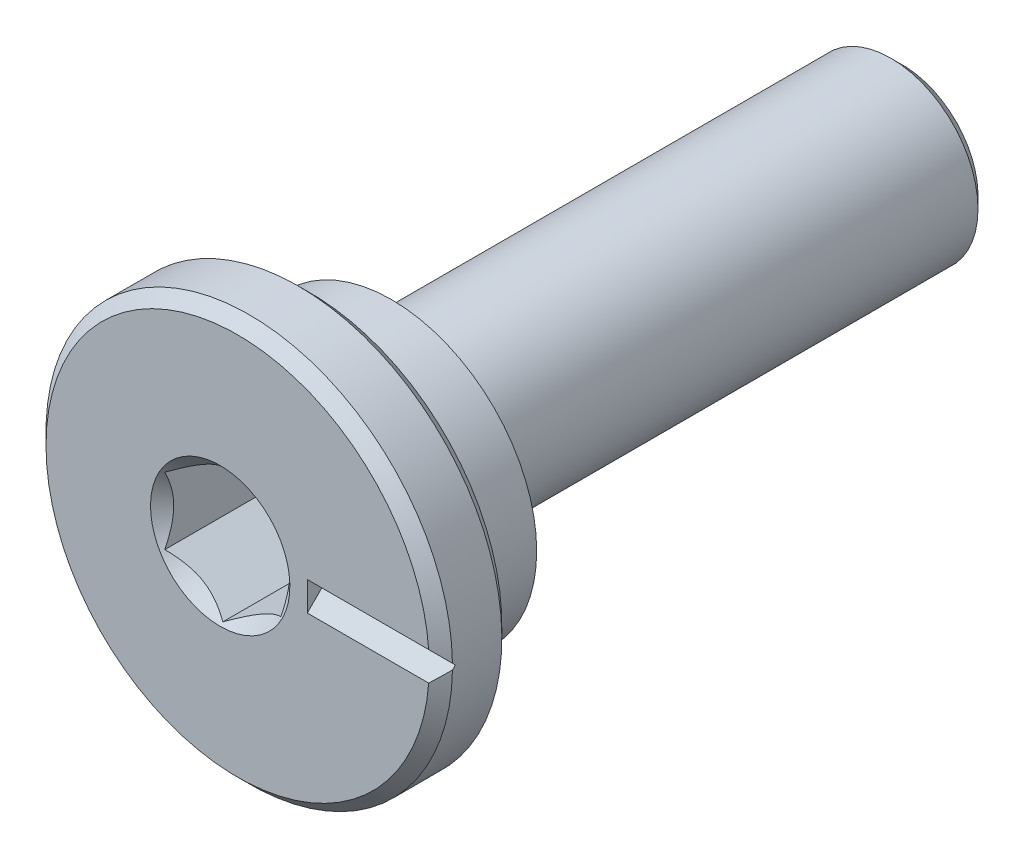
ISO-10303-21;
HEADER;
FILE_DESCRIPTION(('STEP AP214'),'2;1');
FILE_NAME('part.step','',(''),(''),'','','');
FILE_SCHEMA(('AUTOMOTIVE_DESIGN { 1 0 10303 214 1 1 1 1 }'));
ENDSEC;
DATA;
#1=APPLICATION_CONTEXT('core data for automotive mechanical design processes');
#2=APPLICATION_PROTOCOL_DEFINITION('international standard','automotive_design',2000,#1);
#3=PRODUCT_CONTEXT('',#1,'mechanical');
#4=PRODUCT('Part','Part','',(#3));
#5=PRODUCT_RELATED_PRODUCT_CATEGORY('part','',(#4));
#6=PRODUCT_DEFINITION_FORMATION('','',#4);
#7=PRODUCT_DEFINITION_CONTEXT('part definition',#1,'design');
#8=PRODUCT_DEFINITION('design','',#6,#7);
#9=PRODUCT_DEFINITION_SHAPE('','',#8);
#10=(LENGTH_UNIT() NAMED_UNIT(*) SI_UNIT(.MILLI.,.METRE.));
#11=(NAMED_UNIT(*) PLANE_ANGLE_UNIT() SI_UNIT($,.RADIAN.));
#12=(NAMED_UNIT(*) SI_UNIT($,.STERADIAN.) SOLID_ANGLE_UNIT());
#13=UNCERTAINTY_MEASURE_WITH_UNIT(LENGTH_MEASURE(1.E-05),#10,'distance_accuracy_value','');
#14=(GEOMETRIC_REPRESENTATION_CONTEXT(3) GLOBAL_UNCERTAINTY_ASSIGNED_CONTEXT((#13)) GLOBAL_UNIT_ASSIGNED_CONTEXT((#10,
#11,#12)) REPRESENTATION_CONTEXT('',''));
#15=CARTESIAN_POINT('',(0.,0.,0.));
#16=DIRECTION('',(0.,0.,1.));
#17=DIRECTION('',(1.,0.,0.));
#18=AXIS2_PLACEMENT_3D('',#15,#16,#17);
#19=CARTESIAN_POINT('',(0.,0.,-1.));
#20=DIRECTION('',(0.,0.,1.));
#21=DIRECTION('',(-4.13512093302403E-12,-1.,0.));
#22=AXIS2_PLACEMENT_3D('',#19,#20,#21);
#23=PLANE('',#22);
#24=DIRECTION('',(-4.13512093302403E-12,-1.,0.));
#25=VECTOR('',#24,1.);
#26=CARTESIAN_POINT('',(2.,-8.27024186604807E-12,-1.));
#27=LINE('',#26,#25);
#28=CARTESIAN_POINT('',(2.00000000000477,-8.27093497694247E-12,-1.00000000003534));
#29=VERTEX_POINT('',#28);
#30=CARTESIAN_POINT('',(2.00000000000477,1.15470053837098,-1.));
#31=VERTEX_POINT('',#30);
#32=EDGE_CURVE('E70',#29,#31,#27,.F.);
#33=ORIENTED_EDGE('',*,*,#32,.T.);
#34=DIRECTION('',(-0.86602540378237,0.500000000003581,0.));
#35=VECTOR('',#34,1.);
#36=CARTESIAN_POINT('',(2.00000000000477,1.15470053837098,-1.));
#37=LINE('',#36,#35);
#38=CARTESIAN_POINT('',(1.00000000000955,1.73205080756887,-1.00000000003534));
#39=VERTEX_POINT('',#38);
#40=EDGE_CURVE('E339',#31,#39,#37,.T.);
#41=ORIENTED_EDGE('',*,*,#40,.T.);
#42=CARTESIAN_POINT('',(0.,0.,-1.00000000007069));
#43=DIRECTION('',(0.,0.,1.));
#44=DIRECTION('',(-4.13512093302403E-12,-1.,0.));
#45=AXIS2_PLACEMENT_3D('',#42,#43,#44);
#46=CIRCLE('',#45,2.00000000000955);
#47=EDGE_CURVE('E17',#39,#29,#46,.F.);
#48=ORIENTED_EDGE('',*,*,#47,.T.);
#49=EDGE_LOOP('',(#33,#41,#48));
#50=FACE_BOUND('',#49,.T.);
#51=ADVANCED_FACE('F14',(#50),#23,.T.);
#52=CARTESIAN_POINT('',(0.,0.,-1.));
#53=DIRECTION('',(0.,0.,1.));
#54=DIRECTION('',(-4.13512093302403E-12,-1.,0.));
#55=AXIS2_PLACEMENT_3D('',#52,#53,#54);
#56=PLANE('',#55);
#57=DIRECTION('',(0.866025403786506,0.499999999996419,0.));
#58=VECTOR('',#57,1.);
#59=CARTESIAN_POINT('',(0.999999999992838,-1.73205080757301,-1.));
#60=LINE('',#59,#58);
#61=CARTESIAN_POINT('',(0.999999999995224,-1.73205080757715,-1.00000000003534));
#62=VERTEX_POINT('',#61);
#63=CARTESIAN_POINT('',(1.99999999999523,-1.15470053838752,-1.));
#64=VERTEX_POINT('',#63);
#65=EDGE_CURVE('E334',#62,#64,#60,.T.);
#66=ORIENTED_EDGE('',*,*,#65,.T.);
#67=DIRECTION('',(-4.13512093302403E-12,-1.,0.));
#68=VECTOR('',#67,1.);
#69=CARTESIAN_POINT('',(2.,-8.27024186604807E-12,-1.));
#70=LINE('',#69,#68);
#71=EDGE_CURVE('E329',#64,#29,#70,.F.);
#72=ORIENTED_EDGE('',*,*,#71,.T.);
#73=CARTESIAN_POINT('',(0.,0.,-1.00000000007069));
#74=DIRECTION('',(0.,0.,1.));
#75=DIRECTION('',(-4.13512093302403E-12,-1.,0.));
#76=AXIS2_PLACEMENT_3D('',#73,#74,#75);
#77=CIRCLE('',#76,2.00000000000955);
#78=EDGE_CURVE('E643',#29,#62,#77,.F.);
#79=ORIENTED_EDGE('',*,*,#78,.T.);
#80=EDGE_LOOP('',(#66,#72,#79));
#81=FACE_BOUND('',#80,.T.);
#82=ADVANCED_FACE('F536',(#81),#56,.T.);
#83=CARTESIAN_POINT('',(0.,0.,-1.));
#84=DIRECTION('',(0.,0.,1.));
#85=DIRECTION('',(-4.13512093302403E-12,-1.,0.));
#86=AXIS2_PLACEMENT_3D('',#83,#84,#85);
#87=PLANE('',#86);
#88=DIRECTION('',(-0.866025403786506,-0.499999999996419,0.));
#89=VECTOR('',#88,1.);
#90=CARTESIAN_POINT('',(-0.999999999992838,1.73205080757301,-1.));
#91=LINE('',#90,#89);
#92=CARTESIAN_POINT('',(-0.999999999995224,1.73205080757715,-1.00000000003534));
#93=VERTEX_POINT('',#92);
#94=CARTESIAN_POINT('',(-1.99999999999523,1.15470053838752,-1.));
#95=VERTEX_POINT('',#94);
#96=EDGE_CURVE('E324',#93,#95,#91,.T.);
#97=ORIENTED_EDGE('',*,*,#96,.T.);
#98=DIRECTION('',(-4.13512093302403E-12,-1.,0.));
#99=VECTOR('',#98,1.);
#100=CARTESIAN_POINT('',(-2.,8.27024186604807E-12,-1.));
#101=LINE('',#100,#99);
#102=CARTESIAN_POINT('',(-2.00000000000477,8.27042556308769E-12,-1.00000000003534));
#103=VERTEX_POINT('',#102);
#104=EDGE_CURVE('E86',#95,#103,#101,.T.);
#105=ORIENTED_EDGE('',*,*,#104,.T.);
#106=CARTESIAN_POINT('',(0.,0.,-1.00000000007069));
#107=DIRECTION('',(0.,0.,1.));
#108=DIRECTION('',(-4.13512093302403E-12,-1.,0.));
#109=AXIS2_PLACEMENT_3D('',#106,#107,#108);
#110=CIRCLE('',#109,2.00000000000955);
#111=EDGE_CURVE('E647',#103,#93,#110,.F.);
#112=ORIENTED_EDGE('',*,*,#111,.T.);
#113=EDGE_LOOP('',(#97,#105,#112));
#114=FACE_BOUND('',#113,.T.);
#115=ADVANCED_FACE('F527',(#114),#87,.T.);
#116=CARTESIAN_POINT('',(0.,0.,-1.00000000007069));
#117=DIRECTION('',(0.,0.,1.));
#118=DIRECTION('',(-4.13512093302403E-12,-1.,0.));
#119=AXIS2_PLACEMENT_3D('',#116,#117,#118);
#120=CONICAL_SURFACE('',#119,2.00000000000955,1.02974425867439);
#121=CARTESIAN_POINT('',(0.,0.,-2.20172123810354));
#122=VERTEX_POINT('',#121);
#123=VERTEX_LOOP('',#122);
#124=FACE_BOUND('',#123,.T.);
#125=ORIENTED_EDGE('',*,*,#47,.F.);
#126=CARTESIAN_POINT('',(0.,0.,-1.00000000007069));
#127=DIRECTION('',(0.,0.,1.));
#128=DIRECTION('',(-4.13512093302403E-12,-1.,0.));
#129=AXIS2_PLACEMENT_3D('',#126,#127,#128);
#130=CIRCLE('',#129,2.00000000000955);
#131=EDGE_CURVE('E78',#93,#39,#130,.F.);
#132=ORIENTED_EDGE('',*,*,#131,.F.);
#133=ORIENTED_EDGE('',*,*,#111,.F.);
#134=CARTESIAN_POINT('',(0.,0.,-1.00000000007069));
#135=DIRECTION('',(0.,0.,1.));
#136=DIRECTION('',(-4.13512093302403E-12,-1.,0.));
#137=AXIS2_PLACEMENT_3D('',#134,#135,#136);
#138=CIRCLE('',#137,2.00000000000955);
#139=CARTESIAN_POINT('',(-1.00000000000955,-1.73205080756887,-1.00000000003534));
#140=VERTEX_POINT('',#139);
#141=EDGE_CURVE('E142',#140,#103,#138,.F.);
#142=ORIENTED_EDGE('',*,*,#141,.F.);
#143=CARTESIAN_POINT('',(0.,0.,-1.00000000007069));
#144=DIRECTION('',(0.,0.,1.));
#145=DIRECTION('',(-4.13512093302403E-12,-1.,0.));
#146=AXIS2_PLACEMENT_3D('',#143,#144,#145);
#147=CIRCLE('',#146,2.00000000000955);
#148=EDGE_CURVE('E646',#62,#140,#147,.F.);
#149=ORIENTED_EDGE('',*,*,#148,.F.);
#150=ORIENTED_EDGE('',*,*,#78,.F.);
#151=EDGE_LOOP('',(#125,#132,#133,#142,#149,#150));
#152=FACE_BOUND('',#151,.T.);
#153=ADVANCED_FACE('F519',(#124,#152),#120,.F.);
#154=CARTESIAN_POINT('',(0.,0.,-1.));
#155=DIRECTION('',(0.,0.,1.));
#156=DIRECTION('',(-4.13512093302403E-12,-1.,0.));
#157=AXIS2_PLACEMENT_3D('',#154,#155,#156);
#158=PLANE('',#157);
#159=DIRECTION('',(-4.13512093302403E-12,-1.,0.));
#160=VECTOR('',#159,1.);
#161=CARTESIAN_POINT('',(-1.99999999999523,1.15470053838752,-1.));
#162=LINE('',#161,#160);
#163=CARTESIAN_POINT('',(-2.00000000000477,-1.15470053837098,-1.));
#164=VERTEX_POINT('',#163);
#165=EDGE_CURVE('E141',#103,#164,#162,.T.);
#166=ORIENTED_EDGE('',*,*,#165,.T.);
#167=DIRECTION('',(0.866025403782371,-0.500000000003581,0.));
#168=VECTOR('',#167,1.);
#169=CARTESIAN_POINT('',(-2.00000000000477,-1.15470053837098,-1.));
#170=LINE('',#169,#168);
#171=EDGE_CURVE('E131',#164,#140,#170,.T.);
#172=ORIENTED_EDGE('',*,*,#171,.T.);
#173=ORIENTED_EDGE('',*,*,#141,.T.);
#174=EDGE_LOOP('',(#166,#172,#173));
#175=FACE_BOUND('',#174,.T.);
#176=ADVANCED_FACE('F144',(#175),#158,.T.);
#177=CARTESIAN_POINT('',(0.,0.,-1.));
#178=DIRECTION('',(0.,0.,1.));
#179=DIRECTION('',(-4.13512093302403E-12,-1.,0.));
#180=AXIS2_PLACEMENT_3D('',#177,#178,#179);
#181=PLANE('',#180);
#182=DIRECTION('',(0.866025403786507,0.499999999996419,0.));
#183=VECTOR('',#182,1.);
#184=CARTESIAN_POINT('',(-9.55008641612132E-12,-2.3094010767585,-1.));
#185=LINE('',#184,#183);
#186=CARTESIAN_POINT('',(-9.5500530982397E-12,-2.30940107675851,-1.));
#187=VERTEX_POINT('',#186);
#188=EDGE_CURVE('E300',#187,#62,#185,.T.);
#189=ORIENTED_EDGE('',*,*,#188,.T.);
#190=ORIENTED_EDGE('',*,*,#148,.T.);
#191=DIRECTION('',(0.866025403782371,-0.500000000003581,0.));
#192=VECTOR('',#191,1.);
#193=CARTESIAN_POINT('',(-2.00000000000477,-1.15470053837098,-1.));
#194=LINE('',#193,#192);
#195=EDGE_CURVE('E138',#140,#187,#194,.T.);
#196=ORIENTED_EDGE('',*,*,#195,.T.);
#197=EDGE_LOOP('',(#189,#190,#196));
#198=FACE_BOUND('',#197,.T.);
#199=ADVANCED_FACE('F503',(#198),#181,.T.);
#200=CARTESIAN_POINT('',(0.,0.,-1.));
#201=DIRECTION('',(0.,0.,1.));
#202=DIRECTION('',(-4.13512093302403E-12,-1.,0.));
#203=AXIS2_PLACEMENT_3D('',#200,#201,#202);
#204=PLANE('',#203);
#205=DIRECTION('',(-0.866025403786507,-0.499999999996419,0.));
#206=VECTOR('',#205,1.);
#207=CARTESIAN_POINT('',(9.550059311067E-12,2.3094010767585,-1.));
#208=LINE('',#207,#206);
#209=CARTESIAN_POINT('',(9.54942685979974E-12,2.30940107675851,-1.));
#210=VERTEX_POINT('',#209);
#211=EDGE_CURVE('E305',#210,#93,#208,.T.);
#212=ORIENTED_EDGE('',*,*,#211,.T.);
#213=ORIENTED_EDGE('',*,*,#131,.T.);
#214=DIRECTION('',(-0.866025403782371,0.500000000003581,0.));
#215=VECTOR('',#214,1.);
#216=CARTESIAN_POINT('',(2.00000000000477,1.15470053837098,-1.));
#217=LINE('',#216,#215);
#218=EDGE_CURVE('E291',#39,#210,#217,.T.);
#219=ORIENTED_EDGE('',*,*,#218,.T.);
#220=EDGE_LOOP('',(#212,#213,#219));
#221=FACE_BOUND('',#220,.T.);
#222=ADVANCED_FACE('F496',(#221),#204,.T.);
#223=CARTESIAN_POINT('',(-1.99999999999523,1.15470053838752,-1.));
#224=DIRECTION('',(-1.,4.13512093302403E-12,0.));
#225=DIRECTION('',(-4.13512093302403E-12,-1.,0.));
#226=AXIS2_PLACEMENT_3D('',#223,#224,#225);
#227=PLANE('',#226);
#228=ORIENTED_EDGE('',*,*,#104,.F.);
#229=DIRECTION('',(0.,0.,1.));
#230=VECTOR('',#229,1.);
#231=CARTESIAN_POINT('',(-1.99999999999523,1.15470053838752,-1.));
#232=LINE('',#231,#230);
#233=CARTESIAN_POINT('',(-2.00000000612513,1.15470053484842,2.40940108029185));
#234=VERTEX_POINT('',#233);
#235=EDGE_CURVE('E109',#95,#234,#232,.T.);
#236=ORIENTED_EDGE('',*,*,#235,.T.);
#237=CARTESIAN_POINT('',(-1.99999999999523,1.15470046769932,2.40940104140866));
#238=CARTESIAN_POINT('',(-1.99999999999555,1.0753252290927,2.36975151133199));
#239=CARTESIAN_POINT('',(-1.99999999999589,0.994622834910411,2.33243104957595));
#240=CARTESIAN_POINT('',(-1.99999999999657,0.830062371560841,2.26409887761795));
#241=CARTESIAN_POINT('',(-1.99999999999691,0.746188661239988,2.23312517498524));
#242=CARTESIAN_POINT('',(-1.99999999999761,0.577061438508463,2.18006701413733));
#243=CARTESIAN_POINT('',(-1.99999999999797,0.49185097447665,2.15784923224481));
#244=CARTESIAN_POINT('',(-1.99999999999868,0.319554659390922,2.12361850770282));
#245=CARTESIAN_POINT('',(-1.99999999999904,0.232474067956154,2.11158002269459));
#246=CARTESIAN_POINT('',(-1.99999999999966,0.0823866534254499,2.10071791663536));
#247=CARTESIAN_POINT('',(-1.99999999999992,0.0195735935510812,2.09911045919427));
#248=CARTESIAN_POINT('',(-2.00000000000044,-0.105949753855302,2.10182203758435));
#249=CARTESIAN_POINT('',(-2.0000000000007,-0.168659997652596,2.10614315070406));
#250=CARTESIAN_POINT('',(-2.00000000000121,-0.293488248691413,2.12046596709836));
#251=CARTESIAN_POINT('',(-2.00000000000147,-0.355605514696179,2.13047402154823));
#252=CARTESIAN_POINT('',(-2.00000000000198,-0.478765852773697,2.15562137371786));
#253=CARTESIAN_POINT('',(-2.00000000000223,-0.539809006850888,2.17076027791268));
#254=CARTESIAN_POINT('',(-2.00000000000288,-0.696130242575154,2.21569251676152));
#255=CARTESIAN_POINT('',(-2.00000000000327,-0.790440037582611,2.24886904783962));
#256=CARTESIAN_POINT('',(-2.00000000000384,-0.929115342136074,2.30487396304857));
#257=CARTESIAN_POINT('',(-2.00000000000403,-0.974815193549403,2.32455126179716));
#258=CARTESIAN_POINT('',(-2.00000000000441,-1.06536871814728,2.36569933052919));
#259=CARTESIAN_POINT('',(-2.00000000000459,-1.1102228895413,2.38716900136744));
#260=CARTESIAN_POINT('',(-2.00000000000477,-1.15470046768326,2.40940104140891));
#261=B_SPLINE_CURVE_WITH_KNOTS('',3,(#237,#238,#239,#240,#241,#242,#243,#244,#245,#246,#247,
#248,#249,#250,#251,#252,#253,#254,#255,#256,#257,#258,#259,#260),.UNSPECIFIED.,.F.,.F.,(4,2,2,
2,2,2,2,2,2,2,2,4),(0.,0.266365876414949,0.534283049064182,0.797946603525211,1.06094658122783,
1.24918065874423,1.43748070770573,1.62599146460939,1.8144877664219,2.11378534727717,
2.26302816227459,2.41218011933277),.UNSPECIFIED.);
#262=CARTESIAN_POINT('',(-2.00000000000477,-1.15470050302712,2.40940105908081));
#263=VERTEX_POINT('',#262);
#264=EDGE_CURVE('E149',#234,#263,#261,.T.);
#265=ORIENTED_EDGE('',*,*,#264,.T.);
#266=DIRECTION('',(0.,0.,1.));
#267=VECTOR('',#266,1.);
#268=CARTESIAN_POINT('',(-2.00000000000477,-1.15470053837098,-1.));
#269=LINE('',#268,#267);
#270=EDGE_CURVE('E135',#263,#164,#269,.F.);
#271=ORIENTED_EDGE('',*,*,#270,.T.);
#272=ORIENTED_EDGE('',*,*,#165,.F.);
#273=EDGE_LOOP('',(#228,#236,#265,#271,#272));
#274=FACE_BOUND('',#273,.T.);
#275=ADVANCED_FACE('F147',(#274),#227,.F.);
#276=CARTESIAN_POINT('',(-2.00000000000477,-1.15470053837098,-1.));
#277=DIRECTION('',(-0.500000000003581,-0.866025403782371,0.));
#278=DIRECTION('',(0.866025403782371,-0.500000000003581,0.));
#279=AXIS2_PLACEMENT_3D('',#276,#277,#278);
#280=PLANE('',#279);
#281=ORIENTED_EDGE('',*,*,#171,.F.);
#282=ORIENTED_EDGE('',*,*,#270,.F.);
#283=CARTESIAN_POINT('',(-2.00000001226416,-1.15470053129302,2.4094010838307));
#284=CARTESIAN_POINT('',(-1.93125903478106,-1.19438815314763,2.36975154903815));
#285=CARTESIAN_POINT('',(-1.86136870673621,-1.23473935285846,2.33243108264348));
#286=CARTESIAN_POINT('',(-1.71885515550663,-1.31701959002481,2.26409890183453));
#287=CARTESIAN_POINT('',(-1.64621838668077,-1.35895644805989,2.23312519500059));
#288=CARTESIAN_POINT('',(-1.49974990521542,-1.44352006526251,2.18006702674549));
#289=CARTESIAN_POINT('',(-1.42595547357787,-1.48612530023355,2.15784924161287));
#290=CARTESIAN_POINT('',(-1.27674247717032,-1.57227346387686,2.12361851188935));
#291=CARTESIAN_POINT('',(-1.20132846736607,-1.61581376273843,2.11158002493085));
#292=CARTESIAN_POINT('',(-1.07134894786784,-1.69085747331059,2.10071791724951));
#293=CARTESIAN_POINT('',(-1.01695124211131,-1.72226400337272,2.09911045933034));
#294=CARTESIAN_POINT('',(-0.908244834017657,-1.78502567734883,2.10182203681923));
#295=CARTESIAN_POINT('',(-0.8539361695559,-1.81638079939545,2.10614314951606));
#296=CARTESIAN_POINT('',(-0.745831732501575,-1.87879492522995,2.12046596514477));
#297=CARTESIAN_POINT('',(-0.692036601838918,-1.90985355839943,2.13047401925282));
#298=CARTESIAN_POINT('',(-0.585376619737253,-1.97143372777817,2.15562137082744));
#299=CARTESIAN_POINT('',(-0.532511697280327,-2.00195530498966,2.17076027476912));
#300=CARTESIAN_POINT('',(-0.397133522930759,-2.08011593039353,2.21569251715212));
#301=CARTESIAN_POINT('',(-0.315458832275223,-2.12727083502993,2.24886905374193));
#302=CARTESIAN_POINT('',(-0.195362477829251,-2.19660849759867,2.30487397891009));
#303=CARTESIAN_POINT('',(-0.155785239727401,-2.21945842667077,2.32455128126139));
#304=CARTESIAN_POINT('',(-0.0773635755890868,-2.26473519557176,2.36569935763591));
#305=CARTESIAN_POINT('',(-0.0385187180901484,-2.28716228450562,2.38716903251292));
#306=CARTESIAN_POINT('',(1.09406949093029E-12,-2.30940107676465,2.4094010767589));
#307=B_SPLINE_CURVE_WITH_KNOTS('',3,(#283,#284,#285,#286,#287,#288,#289,#290,#291,#292,#293,
#294,#295,#296,#297,#298,#299,#300,#301,#302,#303,#304,#305,#306),.UNSPECIFIED.,.F.,.F.,(4,2,2,
2,2,2,2,2,2,2,2,4),(0.,0.266365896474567,0.534283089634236,0.797946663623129,1.06094666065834,
1.24918073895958,1.43748078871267,1.62599154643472,1.81448784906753,2.11378547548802,
2.26302831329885,2.41218029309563),.UNSPECIFIED.);
#308=CARTESIAN_POINT('',(-9.55059594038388E-12,-2.30940107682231,2.40940107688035));
#309=VERTEX_POINT('',#308);
#310=EDGE_CURVE('E224',#263,#309,#307,.T.);
#311=ORIENTED_EDGE('',*,*,#310,.T.);
#312=DIRECTION('',(0.,0.,1.));
#313=VECTOR('',#312,1.);
#314=CARTESIAN_POINT('',(-9.55091034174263E-12,-2.30940107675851,-1.));
#315=LINE('',#314,#313);
#316=EDGE_CURVE('E303',#309,#187,#315,.F.);
#317=ORIENTED_EDGE('',*,*,#316,.T.);
#318=ORIENTED_EDGE('',*,*,#195,.F.);
#319=EDGE_LOOP('',(#281,#282,#311,#317,#318));
#320=FACE_BOUND('',#319,.T.);
#321=ADVANCED_FACE('F133',(#320),#280,.F.);
#322=CARTESIAN_POINT('',(9.550059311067E-12,2.3094010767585,-1.));
#323=DIRECTION('',(-0.499999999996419,0.866025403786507,0.));
#324=DIRECTION('',(-0.866025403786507,-0.499999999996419,0.));
#325=AXIS2_PLACEMENT_3D('',#322,#323,#324);
#326=PLANE('',#325);
#327=ORIENTED_EDGE('',*,*,#211,.F.);
#328=DIRECTION('',(0.,0.,1.));
#329=VECTOR('',#328,1.);
#330=CARTESIAN_POINT('',(9.54965273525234E-12,2.30940107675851,-1.));
#331=LINE('',#330,#329);
#332=CARTESIAN_POINT('',(9.5497234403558E-12,2.30940107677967,2.40940107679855));
#333=VERTEX_POINT('',#332);
#334=EDGE_CURVE('E292',#210,#333,#331,.T.);
#335=ORIENTED_EDGE('',*,*,#334,.T.);
#336=CARTESIAN_POINT('',(2.01951987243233E-11,2.30940107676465,2.4094010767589));
#337=CARTESIAN_POINT('',(-0.068740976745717,2.26971345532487,2.36975154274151));
#338=CARTESIAN_POINT('',(-0.138631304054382,2.22936225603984,2.33243107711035));
#339=CARTESIAN_POINT('',(-0.281144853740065,2.14708201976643,2.2640988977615));
#340=CARTESIAN_POINT('',(-0.353781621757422,2.10514516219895,2.23312519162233));
#341=CARTESIAN_POINT('',(-0.500250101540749,2.02058154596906,2.18006702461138));
#342=CARTESIAN_POINT('',(-0.574044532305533,1.97797631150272,2.15784924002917));
#343=CARTESIAN_POINT('',(-0.723257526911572,1.89182814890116,2.12361851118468));
#344=CARTESIAN_POINT('',(-0.798671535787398,1.84828785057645,2.11158002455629));
#345=CARTESIAN_POINT('',(-0.928651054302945,1.77324414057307,2.10071791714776));
#346=CARTESIAN_POINT('',(-0.983048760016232,1.74183761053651,2.0991104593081));
#347=CARTESIAN_POINT('',(-1.0917551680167,1.6790759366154,2.10182203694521));
#348=CARTESIAN_POINT('',(-1.1460638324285,1.64772081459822,2.1061431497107));
#349=CARTESIAN_POINT('',(-1.2541682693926,1.585306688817,2.1204659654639));
#350=CARTESIAN_POINT('',(-1.30796340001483,1.55424805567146,2.13047401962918));
#351=CARTESIAN_POINT('',(-1.41462338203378,1.49266788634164,2.15562137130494));
#352=CARTESIAN_POINT('',(-1.46748830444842,1.46214630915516,2.17076027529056));
#353=CARTESIAN_POINT('',(-1.60286648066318,1.38398568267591,2.21569251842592));
#354=CARTESIAN_POINT('',(-1.68454117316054,1.33683077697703,2.24886905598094));
#355=CARTESIAN_POINT('',(-1.8046375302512,1.2674931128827,2.30487398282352));
#356=CARTESIAN_POINT('',(-1.84421476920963,1.24464318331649,2.32455128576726));
#357=CARTESIAN_POINT('',(-1.92263643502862,1.19936641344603,2.36569936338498));
#358=CARTESIAN_POINT('',(-1.96148129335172,1.17693932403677,2.3871690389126));
#359=CARTESIAN_POINT('',(-2.00000001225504,1.15470053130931,2.40940108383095));
#360=B_SPLINE_CURVE_WITH_KNOTS('',3,(#336,#337,#338,#339,#340,#341,#342,#343,#344,#345,#346,
#347,#348,#349,#350,#351,#352,#353,#354,#355,#356,#357,#358,#359),.UNSPECIFIED.,.F.,.F.,(4,2,2,
2,2,2,2,2,2,2,2,4),(0.,0.266365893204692,0.534283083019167,0.797946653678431,1.06094664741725,
1.24918072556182,1.43748077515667,1.62599153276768,1.81448783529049,2.1137854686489,
2.26302830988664,2.41218029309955),.UNSPECIFIED.);
#361=EDGE_CURVE('E209',#333,#234,#360,.T.);
#362=ORIENTED_EDGE('',*,*,#361,.T.);
#363=ORIENTED_EDGE('',*,*,#235,.F.);
#364=ORIENTED_EDGE('',*,*,#96,.F.);
#365=EDGE_LOOP('',(#327,#335,#362,#363,#364));
#366=FACE_BOUND('',#365,.T.);
#367=ADVANCED_FACE('F254',(#366),#326,.F.);
#368=CARTESIAN_POINT('',(-9.55008641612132E-12,-2.3094010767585,-1.));
#369=DIRECTION('',(0.499999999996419,-0.866025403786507,0.));
#370=DIRECTION('',(0.866025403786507,0.499999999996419,0.));
#371=AXIS2_PLACEMENT_3D('',#368,#369,#370);
#372=PLANE('',#371);
#373=ORIENTED_EDGE('',*,*,#188,.F.);
#374=ORIENTED_EDGE('',*,*,#316,.F.);
#375=CARTESIAN_POINT('',(-2.01952877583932E-11,-2.30940107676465,2.4094010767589));
#376=CARTESIAN_POINT('',(0.0687409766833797,-2.26971345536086,2.36975154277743));
#377=CARTESIAN_POINT('',(0.138631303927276,-2.22936225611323,2.33243107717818));
#378=CARTESIAN_POINT('',(0.28114485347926,-2.14708201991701,2.26409889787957));
#379=CARTESIAN_POINT('',(0.353781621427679,-2.10514516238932,2.23312519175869));
#380=CARTESIAN_POINT('',(0.500250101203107,-2.02058154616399,2.18006702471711));
#381=CARTESIAN_POINT('',(0.574044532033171,-1.97797631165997,2.15784924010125));
#382=CARTESIAN_POINT('',(0.723257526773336,-1.89182814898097,2.12361851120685));
#383=CARTESIAN_POINT('',(0.798671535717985,-1.84828785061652,2.11158002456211));
#384=CARTESIAN_POINT('',(0.92865105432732,-1.773244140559,2.1007179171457));
#385=CARTESIAN_POINT('',(0.983048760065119,-1.74183761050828,2.09911045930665));
#386=CARTESIAN_POINT('',(1.09175516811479,-1.67907593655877,2.10182203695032));
#387=CARTESIAN_POINT('',(1.1460638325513,-1.64772081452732,2.10614314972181));
#388=CARTESIAN_POINT('',(1.25416826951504,-1.5853066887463,2.12046596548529));
#389=CARTESIAN_POINT('',(1.30796340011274,-1.55424805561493,2.13047401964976));
#390=CARTESIAN_POINT('',(1.41462338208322,-1.4926678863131,2.1556213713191));
#391=CARTESIAN_POINT('',(1.46748830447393,-1.46214630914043,2.170760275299));
#392=CARTESIAN_POINT('',(1.60286646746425,-1.38398569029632,2.21569251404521));
#393=CARTESIAN_POINT('',(1.684541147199,-1.33683079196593,2.24886904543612));
#394=CARTESIAN_POINT('',(1.80463748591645,-1.26749313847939,2.30487396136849));
#395=CARTESIAN_POINT('',(1.84421471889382,-1.24464321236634,2.32455126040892));
#396=CARTESIAN_POINT('',(1.92263637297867,-1.19936644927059,2.36569932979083));
#397=CARTESIAN_POINT('',(1.96148122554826,-1.17693936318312,2.38716900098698));
#398=CARTESIAN_POINT('',(1.9999999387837,-1.15470057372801,2.40940104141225));
#399=B_SPLINE_CURVE_WITH_KNOTS('',3,(#375,#376,#377,#378,#379,#380,#381,#382,#383,#384,#385,
#386,#387,#388,#389,#390,#391,#392,#393,#394,#395,#396,#397,#398),.UNSPECIFIED.,.F.,.F.,(4,2,2,
2,2,2,2,2,2,2,2,4),(0.,0.26636589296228,0.534283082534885,0.797946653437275,1.06094664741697,
1.24918072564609,1.4374807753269,1.62599153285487,1.81448783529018,2.11378542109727,
2.26302823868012,2.41218019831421),.UNSPECIFIED.);
#400=CARTESIAN_POINT('',(1.99999996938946,-1.15470055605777,2.40940105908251));
#401=VERTEX_POINT('',#400);
#402=EDGE_CURVE('E257',#309,#401,#399,.T.);
#403=ORIENTED_EDGE('',*,*,#402,.T.);
#404=DIRECTION('',(0.,0.,1.));
#405=VECTOR('',#404,1.);
#406=CARTESIAN_POINT('',(1.99999999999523,-1.15470053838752,-1.));
#407=LINE('',#406,#405);
#408=EDGE_CURVE('E296',#401,#64,#407,.F.);
#409=ORIENTED_EDGE('',*,*,#408,.T.);
#410=ORIENTED_EDGE('',*,*,#65,.F.);
#411=EDGE_LOOP('',(#373,#374,#403,#409,#410));
#412=FACE_BOUND('',#411,.T.);
#413=ADVANCED_FACE('F251',(#412),#372,.F.);
#414=CARTESIAN_POINT('',(1.99999999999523,-1.15470053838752,-1.));
#415=DIRECTION('',(1.,-4.13530872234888E-12,0.));
#416=DIRECTION('',(4.13530872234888E-12,1.,0.));
#417=AXIS2_PLACEMENT_3D('',#414,#415,#416);
#418=PLANE('',#417);
#419=ORIENTED_EDGE('',*,*,#71,.F.);
#420=ORIENTED_EDGE('',*,*,#408,.F.);
#421=CARTESIAN_POINT('',(1.99999999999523,-1.15470055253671,2.40940108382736));
#422=CARTESIAN_POINT('',(1.99999999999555,-1.07532530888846,2.36975154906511));
#423=CARTESIAN_POINT('',(1.99999999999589,-0.994622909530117,2.33243108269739));
#424=CARTESIAN_POINT('',(1.99999999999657,-0.830062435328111,2.26409890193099));
#425=CARTESIAN_POINT('',(1.99999999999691,-0.746188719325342,2.23312519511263));
#426=CARTESIAN_POINT('',(1.99999999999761,-0.577061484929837,2.1800670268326));
#427=CARTESIAN_POINT('',(1.99999999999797,-0.49185101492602,2.15784924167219));
#428=CARTESIAN_POINT('',(1.99999999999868,-0.319554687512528,2.1236185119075));
#429=CARTESIAN_POINT('',(1.99999999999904,-0.232474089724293,2.11158002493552));
#430=CARTESIAN_POINT('',(1.99999999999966,-0.0823866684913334,2.10071791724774));
#431=CARTESIAN_POINT('',(1.99999999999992,-0.0195736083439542,2.09911045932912));
#432=CARTESIAN_POINT('',(2.00000000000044,0.105949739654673,2.10182203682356));
#433=CARTESIAN_POINT('',(2.0000000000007,0.168659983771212,2.10614314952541));
#434=CARTESIAN_POINT('',(2.00000000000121,0.293488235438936,2.12046596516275));
#435=CARTESIAN_POINT('',(2.00000000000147,0.355605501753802,2.13047401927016));
#436=CARTESIAN_POINT('',(2.00000000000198,0.478765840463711,2.15562137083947));
#437=CARTESIAN_POINT('',(2.00000000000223,0.539808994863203,2.17076027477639));
#438=CARTESIAN_POINT('',(2.00000000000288,0.696130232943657,2.21569251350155));
#439=CARTESIAN_POINT('',(2.00000000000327,0.790440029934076,2.24886904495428));
#440=CARTESIAN_POINT('',(2.00000000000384,0.92911533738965,2.30487396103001));
#441=CARTESIAN_POINT('',(2.00000000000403,0.974815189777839,2.32455126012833));
#442=CARTESIAN_POINT('',(2.00000000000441,1.06536871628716,2.36569932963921));
#443=CARTESIAN_POINT('',(2.00000000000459,1.11022288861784,2.38716900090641));
#444=CARTESIAN_POINT('',(2.00000000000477,1.15470046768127,2.40940104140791));
#445=B_SPLINE_CURVE_WITH_KNOTS('',3,(#421,#422,#423,#424,#425,#426,#427,#428,#429,#430,#431,
#432,#433,#434,#435,#436,#437,#438,#439,#440,#441,#442,#443,#444),.UNSPECIFIED.,.F.,.F.,(4,2,2,
2,2,2,2,2,2,2,2,4),(0.,0.266365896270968,0.534283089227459,0.797946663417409,1.06094666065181,
1.24918073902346,1.4374807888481,1.62599154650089,1.81448784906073,2.11378543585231,
2.26302825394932,2.41218021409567),.UNSPECIFIED.);
#446=CARTESIAN_POINT('',(2.00000000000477,1.15470050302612,2.40940105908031));
#447=VERTEX_POINT('',#446);
#448=EDGE_CURVE('E198',#401,#447,#445,.T.);
#449=ORIENTED_EDGE('',*,*,#448,.T.);
#450=DIRECTION('',(0.,0.,1.));
#451=VECTOR('',#450,1.);
#452=CARTESIAN_POINT('',(2.00000000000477,1.15470053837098,-1.));
#453=LINE('',#452,#451);
#454=EDGE_CURVE('E289',#447,#31,#453,.F.);
#455=ORIENTED_EDGE('',*,*,#454,.T.);
#456=ORIENTED_EDGE('',*,*,#32,.F.);
#457=EDGE_LOOP('',(#419,#420,#449,#455,#456));
#458=FACE_BOUND('',#457,.T.);
#459=ADVANCED_FACE('F246',(#458),#418,.F.);
#460=CARTESIAN_POINT('',(2.00000000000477,1.15470053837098,-1.));
#461=DIRECTION('',(0.500000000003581,0.866025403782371,0.));
#462=DIRECTION('',(-0.866025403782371,0.500000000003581,0.));
#463=AXIS2_PLACEMENT_3D('',#460,#461,#462);
#464=PLANE('',#463);
#465=ORIENTED_EDGE('',*,*,#40,.F.);
#466=ORIENTED_EDGE('',*,*,#454,.F.);
#467=CARTESIAN_POINT('',(2.00000001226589,1.15470053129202,2.40940108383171));
#468=CARTESIAN_POINT('',(1.93125903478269,1.19438815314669,2.36975154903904));
#469=CARTESIAN_POINT('',(1.86136870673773,1.23473935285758,2.33243108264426));
#470=CARTESIAN_POINT('',(1.71885515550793,1.31701959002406,2.2640989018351));
#471=CARTESIAN_POINT('',(1.64621838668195,1.35895644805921,2.23312519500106));
#472=CARTESIAN_POINT('',(1.49974990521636,1.44352006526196,2.18006702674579));
#473=CARTESIAN_POINT('',(1.42595547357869,1.48612530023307,2.1578492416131));
#474=CARTESIAN_POINT('',(1.27674247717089,1.57227346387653,2.12361851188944));
#475=CARTESIAN_POINT('',(1.20132846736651,1.61581376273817,2.11158002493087));
#476=CARTESIAN_POINT('',(1.07134894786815,1.69085747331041,2.1007179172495));
#477=CARTESIAN_POINT('',(1.01695124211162,1.72226400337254,2.09911045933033));
#478=CARTESIAN_POINT('',(0.908244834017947,1.78502567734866,2.10182203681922));
#479=CARTESIAN_POINT('',(0.853936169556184,1.81638079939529,2.10614314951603));
#480=CARTESIAN_POINT('',(0.745831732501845,1.8787949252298,2.12046596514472));
#481=CARTESIAN_POINT('',(0.692036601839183,1.90985355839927,2.13047401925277));
#482=CARTESIAN_POINT('',(0.585376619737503,1.97143372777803,2.15562137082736));
#483=CARTESIAN_POINT('',(0.532511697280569,2.00195530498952,2.17076027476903));
#484=CARTESIAN_POINT('',(0.397133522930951,2.08011593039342,2.21569251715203));
#485=CARTESIAN_POINT('',(0.315458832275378,2.12727083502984,2.24886905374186));
#486=CARTESIAN_POINT('',(0.195362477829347,2.19660849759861,2.30487397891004));
#487=CARTESIAN_POINT('',(0.155785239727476,2.21945842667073,2.32455128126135));
#488=CARTESIAN_POINT('',(0.0773635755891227,2.26473519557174,2.36569935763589));
#489=CARTESIAN_POINT('',(0.0385187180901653,2.28716228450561,2.38716903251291));
#490=CARTESIAN_POINT('',(-1.09446213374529E-12,2.30940107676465,2.4094010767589));
#491=B_SPLINE_CURVE_WITH_KNOTS('',3,(#467,#468,#469,#470,#471,#472,#473,#474,#475,#476,#477,
#478,#479,#480,#481,#482,#483,#484,#485,#486,#487,#488,#489,#490),.UNSPECIFIED.,.F.,.F.,(4,2,2,
2,2,2,2,2,2,2,2,4),(0.,0.266365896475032,0.534283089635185,0.797946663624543,1.06094666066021,
1.24918073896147,1.43748078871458,1.62599154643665,1.81448784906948,2.11378547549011,
2.26302831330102,2.41218029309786),.UNSPECIFIED.);
#492=EDGE_CURVE('E230',#447,#333,#491,.T.);
#493=ORIENTED_EDGE('',*,*,#492,.T.);
#494=ORIENTED_EDGE('',*,*,#334,.F.);
#495=ORIENTED_EDGE('',*,*,#218,.F.);
#496=EDGE_LOOP('',(#465,#466,#493,#494,#495));
#497=FACE_BOUND('',#496,.T.);
#498=ADVANCED_FACE('F241',(#497),#464,.F.);
#499=CARTESIAN_POINT('',(2.99999999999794,-0.500000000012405,2.5));
#500=DIRECTION('',(-2.92397205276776E-12,-0.707106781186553,-0.707106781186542));
#501=DIRECTION('',(2.92397205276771E-12,0.707106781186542,-0.707106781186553));
#502=AXIS2_PLACEMENT_3D('',#499,#500,#501);
#503=PLANE('',#502);
#504=DIRECTION('',(-2.92397205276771E-12,-0.707106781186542,0.707106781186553));
#505=VECTOR('',#504,1.);
#506=CARTESIAN_POINT('',(3.,-1.24053356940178E-11,2.));
#507=LINE('',#506,#505);
#508=CARTESIAN_POINT('',(3.,-1.24053902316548E-11,2.));
#509=VERTEX_POINT('',#508);
#510=CARTESIAN_POINT('',(2.99999999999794,-0.500000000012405,2.5));
#511=VERTEX_POINT('',#510);
#512=EDGE_CURVE('E166',#509,#511,#507,.T.);
#513=ORIENTED_EDGE('',*,*,#512,.T.);
#514=DIRECTION('',(1.,-4.13512093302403E-12,0.));
#515=VECTOR('',#514,1.);
#516=CARTESIAN_POINT('',(7.19999999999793,-0.500000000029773,2.5));
#517=LINE('',#516,#515);
#518=CARTESIAN_POINT('',(7.18103335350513,-0.500000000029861,2.50000000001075));
#519=VERTEX_POINT('',#518);
#520=EDGE_CURVE('E238',#511,#519,#517,.T.);
#521=ORIENTED_EDGE('',*,*,#520,.T.);
#522=CARTESIAN_POINT('',(7.59928567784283,-0.100000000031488,2.10000000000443));
#523=CARTESIAN_POINT('',(7.58183377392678,-0.117204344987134,2.11720433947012));
#524=CARTESIAN_POINT('',(7.56433880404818,-0.13438689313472,2.13438680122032));
#525=CARTESIAN_POINT('',(7.52936687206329,-0.168604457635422,2.16860412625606));
#526=CARTESIAN_POINT('',(7.51189043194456,-0.18563974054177,2.18563925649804));
#527=CARTESIAN_POINT('',(7.4769559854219,-0.219562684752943,2.21956192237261));
#528=CARTESIAN_POINT('',(7.45949850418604,-0.236450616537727,2.23644972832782));
#529=CARTESIAN_POINT('',(7.42460241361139,-0.270078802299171,2.27007774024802));
#530=CARTESIAN_POINT('',(7.40716433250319,-0.286819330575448,2.28681822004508));
#531=CARTESIAN_POINT('',(7.37230749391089,-0.320152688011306,2.32015157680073));
#532=CARTESIAN_POINT('',(7.35488926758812,-0.336745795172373,2.33674473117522));
#533=CARTESIAN_POINT('',(7.32007260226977,-0.369784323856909,2.36978343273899));
#534=CARTESIAN_POINT('',(7.30267469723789,-0.386230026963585,2.38622926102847));
#535=CARTESIAN_POINT('',(7.2678991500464,-0.41897379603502,2.41897330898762));
#536=CARTESIAN_POINT('',(7.25052204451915,-0.435272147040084,2.43527181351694));
#537=CARTESIAN_POINT('',(7.2157885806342,-0.467721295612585,2.46772120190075));
#538=CARTESIAN_POINT('',(7.19843276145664,-0.483872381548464,2.48387237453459));
#539=CARTESIAN_POINT('',(7.18103335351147,-0.500000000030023,2.50000000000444));
#540=B_SPLINE_CURVE_WITH_KNOTS('',3,(#522,#523,#524,#525,#526,#527,#528,#529,#530,#531,#532,
#533,#534,#535,#536,#537,#538,#539),.UNSPECIFIED.,.F.,.F.,(4,2,2,2,2,2,2,2,4),(0.,
0.0898271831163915,0.179115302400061,0.267864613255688,0.35607541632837,0.443748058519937,
0.530882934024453,0.617480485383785,0.703541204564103),.UNSPECIFIED.);
#541=CARTESIAN_POINT('',(7.59928567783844,-0.100000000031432,2.10000000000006));
#542=VERTEX_POINT('',#541);
#543=EDGE_CURVE('E167',#542,#519,#540,.T.);
#544=ORIENTED_EDGE('',*,*,#543,.F.);
#545=CARTESIAN_POINT('',(7.6,-3.14156102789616E-11,2.));
#546=CARTESIAN_POINT('',(7.60000000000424,-0.00416680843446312,2.00416666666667));
#547=CARTESIAN_POINT('',(7.59999627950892,-0.00833361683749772,2.00833333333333));
#548=CARTESIAN_POINT('',(7.59998139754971,-0.0166672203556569,2.01666666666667));
#549=CARTESIAN_POINT('',(7.59997023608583,-0.0208340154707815,2.02083333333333));
#550=CARTESIAN_POINT('',(7.59994047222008,-0.0291675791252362,2.02916666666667));
#551=CARTESIAN_POINT('',(7.59992186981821,-0.0333343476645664,2.03333333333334));
#552=CARTESIAN_POINT('',(7.59987722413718,-0.0416678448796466,2.04166666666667));
#553=CARTESIAN_POINT('',(7.59985118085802,-0.0458345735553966,2.04583333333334));
#554=CARTESIAN_POINT('',(7.59979165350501,-0.0541679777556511,2.05416666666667));
#555=CARTESIAN_POINT('',(7.59975816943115,-0.0583346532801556,2.05833333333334));
#556=CARTESIAN_POINT('',(7.59968376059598,-0.0666679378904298,2.06666666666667));
#557=CARTESIAN_POINT('',(7.59964283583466,-0.0708345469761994,2.07083333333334));
#558=CARTESIAN_POINT('',(7.59955354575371,-0.079167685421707,2.07916666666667));
#559=CARTESIAN_POINT('',(7.59950518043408,-0.083334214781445,2.08333333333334));
#560=CARTESIAN_POINT('',(7.59940100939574,-0.0916671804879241,2.09166666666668));
#561=CARTESIAN_POINT('',(7.59934520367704,-0.0958336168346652,2.09583333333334));
#562=CARTESIAN_POINT('',(7.59928567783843,-0.100000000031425,2.10000000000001));
#563=B_SPLINE_CURVE_WITH_KNOTS('',3,(#545,#546,#547,#548,#549,#550,#551,#552,#553,#554,#555,
#556,#557,#558,#559,#560,#561,#562),.UNSPECIFIED.,.F.,.F.,(4,2,2,2,2,2,2,2,4),(0.,
0.0176779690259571,0.0353559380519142,0.0530339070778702,0.0707118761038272,0.0883898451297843,
0.10606781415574,0.123745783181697,0.141423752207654),.UNSPECIFIED.);
#564=CARTESIAN_POINT('',(7.6,2.49983202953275E-07,2.00000025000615));
#565=VERTEX_POINT('',#564);
#566=EDGE_CURVE('E372',#565,#542,#563,.T.);
#567=ORIENTED_EDGE('',*,*,#566,.F.);
#568=DIRECTION('',(1.,-4.13512093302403E-12,0.));
#569=VECTOR('',#568,1.);
#570=CARTESIAN_POINT('',(3.,-1.24053356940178E-11,2.));
#571=LINE('',#570,#569);
#572=EDGE_CURVE('E117',#565,#509,#571,.F.);
#573=ORIENTED_EDGE('',*,*,#572,.T.);
#574=EDGE_LOOP('',(#513,#521,#544,#567,#573));
#575=FACE_BOUND('',#574,.T.);
#576=ADVANCED_FACE('F245',(#575),#503,.F.);
#577=CARTESIAN_POINT('',(3.,-1.24053356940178E-11,2.));
#578=DIRECTION('',(2.92397205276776E-12,0.707106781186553,-0.707106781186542));
#579=DIRECTION('',(2.92397205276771E-12,0.707106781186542,0.707106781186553));
#580=AXIS2_PLACEMENT_3D('',#577,#578,#579);
#581=PLANE('',#580);
#582=DIRECTION('',(1.,-4.13512093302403E-12,0.));
#583=VECTOR('',#582,1.);
#584=CARTESIAN_POINT('',(7.20000000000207,0.499999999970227,2.5));
#585=LINE('',#584,#583);
#586=CARTESIAN_POINT('',(7.18103335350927,0.499999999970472,2.50000000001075));
#587=VERTEX_POINT('',#586);
#588=CARTESIAN_POINT('',(3.00000000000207,0.499999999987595,2.5));
#589=VERTEX_POINT('',#588);
#590=EDGE_CURVE('E284',#587,#589,#585,.F.);
#591=ORIENTED_EDGE('',*,*,#590,.T.);
#592=DIRECTION('',(-2.92397205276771E-12,-0.707106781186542,-0.707106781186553));
#593=VECTOR('',#592,1.);
#594=CARTESIAN_POINT('',(3.00000000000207,0.499999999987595,2.5));
#595=LINE('',#594,#593);
#596=EDGE_CURVE('E268',#589,#509,#595,.T.);
#597=ORIENTED_EDGE('',*,*,#596,.T.);
#598=ORIENTED_EDGE('',*,*,#572,.F.);
#599=CARTESIAN_POINT('',(7.59928567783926,0.0999999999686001,2.10000000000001));
#600=CARTESIAN_POINT('',(7.59934520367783,0.0958336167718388,2.09583333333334));
#601=CARTESIAN_POINT('',(7.5994010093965,0.0916671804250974,2.09166666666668));
#602=CARTESIAN_POINT('',(7.59950518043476,0.0833342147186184,2.08333333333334));
#603=CARTESIAN_POINT('',(7.59955354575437,0.0791676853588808,2.07916666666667));
#604=CARTESIAN_POINT('',(7.59964283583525,0.0708345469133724,2.07083333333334));
#605=CARTESIAN_POINT('',(7.59968376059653,0.0666679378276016,2.06666666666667));
#606=CARTESIAN_POINT('',(7.59975816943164,0.0583346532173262,2.05833333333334));
#607=CARTESIAN_POINT('',(7.59979165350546,0.0541679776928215,2.05416666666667));
#608=CARTESIAN_POINT('',(7.5998511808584,0.0458345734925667,2.04583333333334));
#609=CARTESIAN_POINT('',(7.59987722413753,0.0416678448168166,2.04166666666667));
#610=CARTESIAN_POINT('',(7.59992186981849,0.0333343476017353,2.03333333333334));
#611=CARTESIAN_POINT('',(7.59994047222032,0.0291675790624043,2.02916666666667));
#612=CARTESIAN_POINT('',(7.599970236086,0.0208340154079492,2.02083333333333));
#613=CARTESIAN_POINT('',(7.59998139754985,0.0166672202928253,2.01666666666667));
#614=CARTESIAN_POINT('',(7.59999627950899,0.00833361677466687,2.00833333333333));
#615=CARTESIAN_POINT('',(7.60000000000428,0.00416680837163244,2.00416666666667));
#616=CARTESIAN_POINT('',(7.6,-3.14156102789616E-11,2.));
#617=B_SPLINE_CURVE_WITH_KNOTS('',3,(#599,#600,#601,#602,#603,#604,#605,#606,#607,#608,#609,
#610,#611,#612,#613,#614,#615,#616),.UNSPECIFIED.,.F.,.F.,(4,2,2,2,2,2,2,2,4),(0.,
0.0176779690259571,0.0353559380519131,0.0530339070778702,0.0707118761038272,0.0883898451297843,
0.106067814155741,0.123745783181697,0.141423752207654),.UNSPECIFIED.);
#618=CARTESIAN_POINT('',(7.59928567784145,0.099999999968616,2.1000000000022));
#619=VERTEX_POINT('',#618);
#620=EDGE_CURVE('E160',#619,#565,#617,.T.);
#621=ORIENTED_EDGE('',*,*,#620,.F.);
#622=CARTESIAN_POINT('',(7.18103335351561,0.499999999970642,2.50000000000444));
#623=CARTESIAN_POINT('',(7.19843276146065,0.483872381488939,2.48387237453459));
#624=CARTESIAN_POINT('',(7.21578858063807,0.467721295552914,2.46772120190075));
#625=CARTESIAN_POINT('',(7.25052204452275,0.435272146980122,2.43527181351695));
#626=CARTESIAN_POINT('',(7.26789915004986,0.418973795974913,2.41897330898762));
#627=CARTESIAN_POINT('',(7.30267469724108,0.386230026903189,2.38622926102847));
#628=CARTESIAN_POINT('',(7.32007260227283,0.369784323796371,2.36978343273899));
#629=CARTESIAN_POINT('',(7.3548892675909,0.336745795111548,2.33674473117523));
#630=CARTESIAN_POINT('',(7.37230749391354,0.320152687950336,2.32015157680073));
#631=CARTESIAN_POINT('',(7.40716433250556,0.286819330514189,2.28681822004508));
#632=CARTESIAN_POINT('',(7.42460241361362,0.270078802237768,2.27007774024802));
#633=CARTESIAN_POINT('',(7.45949850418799,0.236450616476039,2.23644972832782));
#634=CARTESIAN_POINT('',(7.47695598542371,0.219562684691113,2.21956192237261));
#635=CARTESIAN_POINT('',(7.51189043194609,0.185639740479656,2.18563925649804));
#636=CARTESIAN_POINT('',(7.52936687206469,0.168604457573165,2.16860412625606));
#637=CARTESIAN_POINT('',(7.56433880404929,0.134386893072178,2.13438680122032));
#638=CARTESIAN_POINT('',(7.58183377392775,0.11720434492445,2.11720433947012));
#639=CARTESIAN_POINT('',(7.59928567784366,0.0999999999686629,2.10000000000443));
#640=B_SPLINE_CURVE_WITH_KNOTS('',3,(#622,#623,#624,#625,#626,#627,#628,#629,#630,#631,#632,
#633,#634,#635,#636,#637,#638,#639),.UNSPECIFIED.,.F.,.F.,(4,2,2,2,2,2,2,2,4),(0.,
0.0860607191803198,0.172658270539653,0.259793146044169,0.347465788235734,0.435676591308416,
0.524425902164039,0.613714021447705,0.703541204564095),.UNSPECIFIED.);
#641=EDGE_CURVE('E159',#587,#619,#640,.T.);
#642=ORIENTED_EDGE('',*,*,#641,.F.);
#643=EDGE_LOOP('',(#591,#597,#598,#621,#642));
#644=FACE_BOUND('',#643,.T.);
#645=ADVANCED_FACE('F446',(#644),#581,.F.);
#646=CARTESIAN_POINT('',(3.,-1.24053627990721E-11,35.1937365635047));
#647=DIRECTION('',(-1.,4.13512093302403E-12,0.));
#648=DIRECTION('',(-4.13512093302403E-12,-1.,0.));
#649=AXIS2_PLACEMENT_3D('',#646,#647,#648);
#650=PLANE('',#649);
#651=DIRECTION('',(4.13512093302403E-12,1.,0.));
#652=VECTOR('',#651,1.);
#653=CARTESIAN_POINT('',(3.,-1.24053627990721E-11,2.5));
#654=LINE('',#653,#652);
#655=EDGE_CURVE('E281',#589,#511,#654,.F.);
#656=ORIENTED_EDGE('',*,*,#655,.T.);
#657=ORIENTED_EDGE('',*,*,#512,.F.);
#658=ORIENTED_EDGE('',*,*,#596,.F.);
#659=EDGE_LOOP('',(#656,#657,#658));
#660=FACE_BOUND('',#659,.T.);
#661=ADVANCED_FACE('F192',(#660),#650,.F.);
#662=CARTESIAN_POINT('',(0.,0.,2.5000000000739));
#663=DIRECTION('',(0.,0.,1.));
#664=DIRECTION('',(-4.13512093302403E-12,-1.,0.));
#665=AXIS2_PLACEMENT_3D('',#662,#663,#664);
#666=CONICAL_SURFACE('',#665,2.40000000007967,0.785398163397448);
#667=ORIENTED_EDGE('',*,*,#402,.F.);
#668=ORIENTED_EDGE('',*,*,#310,.F.);
#669=ORIENTED_EDGE('',*,*,#264,.F.);
#670=ORIENTED_EDGE('',*,*,#361,.F.);
#671=ORIENTED_EDGE('',*,*,#492,.F.);
#672=ORIENTED_EDGE('',*,*,#448,.F.);
#673=EDGE_LOOP('',(#667,#668,#669,#670,#671,#672));
#674=FACE_BOUND('',#673,.T.);
#675=CARTESIAN_POINT('',(0.,0.,2.5000000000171));
#676=DIRECTION('',(0.,0.,1.));
#677=DIRECTION('',(-4.13512093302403E-12,-1.,0.));
#678=AXIS2_PLACEMENT_3D('',#675,#676,#677);
#679=CIRCLE('',#678,2.40000000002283);
#680=CARTESIAN_POINT('',(-9.92429023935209E-12,-2.40000000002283,2.5000000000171));
#681=VERTEX_POINT('',#680);
#682=EDGE_CURVE('E239',#681,#681,#679,.T.);
#683=ORIENTED_EDGE('',*,*,#682,.T.);
#684=EDGE_LOOP('',(#683));
#685=FACE_BOUND('',#684,.T.);
#686=ADVANCED_FACE('F187',(#674,#685),#666,.F.);
#687=CARTESIAN_POINT('',(7.2,-2.9772870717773E-11,2.5));
#688=DIRECTION('',(0.,0.,-1.));
#689=DIRECTION('',(4.13512093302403E-12,1.,0.));
#690=AXIS2_PLACEMENT_3D('',#687,#688,#689);
#691=PLANE('',#690);
#692=ORIENTED_EDGE('',*,*,#682,.F.);
#693=EDGE_LOOP('',(#692));
#694=FACE_BOUND('',#693,.T.);
#695=ORIENTED_EDGE('',*,*,#590,.F.);
#696=CARTESIAN_POINT('',(0.6,-2.48107255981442E-12,2.5000000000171));
#697=DIRECTION('',(0.,0.,-1.));
#698=DIRECTION('',(4.13512093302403E-12,1.,0.));
#699=AXIS2_PLACEMENT_3D('',#696,#697,#698);
#700=CIRCLE('',#699,6.59999999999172);
#701=EDGE_CURVE('E32',#519,#587,#700,.T.);
#702=ORIENTED_EDGE('',*,*,#701,.F.);
#703=ORIENTED_EDGE('',*,*,#520,.F.);
#704=ORIENTED_EDGE('',*,*,#655,.F.);
#705=EDGE_LOOP('',(#695,#702,#703,#704));
#706=FACE_BOUND('',#705,.T.);
#707=ADVANCED_FACE('F181',(#694,#706),#691,.F.);
#708=CARTESIAN_POINT('',(0.6,-2.48107255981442E-12,2.10000000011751));
#709=DIRECTION('',(0.,0.,-1.));
#710=DIRECTION('',(4.13512093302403E-12,1.,0.));
#711=AXIS2_PLACEMENT_3D('',#708,#709,#710);
#712=CONICAL_SURFACE('',#711,6.99999999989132,0.785398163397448);
#713=ORIENTED_EDGE('',*,*,#701,.T.);
#714=ORIENTED_EDGE('',*,*,#641,.T.);
#715=CARTESIAN_POINT('',(0.6,-2.48107255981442E-12,2.10000000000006));
#716=DIRECTION('',(0.,0.,-1.));
#717=DIRECTION('',(4.13512093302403E-12,1.,0.));
#718=AXIS2_PLACEMENT_3D('',#715,#716,#717);
#719=CIRCLE('',#718,7.);
#720=EDGE_CURVE('E359',#542,#619,#719,.T.);
#721=ORIENTED_EDGE('',*,*,#720,.F.);
#722=ORIENTED_EDGE('',*,*,#543,.T.);
#723=EDGE_LOOP('',(#713,#714,#721,#722));
#724=FACE_BOUND('',#723,.T.);
#725=ADVANCED_FACE('F170',(#724),#712,.T.);
#726=CARTESIAN_POINT('',(0.6,-2.48107255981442E-12,-2.26159332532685));
#727=DIRECTION('',(0.,0.,-1.));
#728=DIRECTION('',(4.13512093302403E-12,1.,0.));
#729=AXIS2_PLACEMENT_3D('',#726,#727,#728);
#730=CYLINDRICAL_SURFACE('',#729,7.);
#731=ORIENTED_EDGE('',*,*,#566,.T.);
#732=ORIENTED_EDGE('',*,*,#720,.T.);
#733=ORIENTED_EDGE('',*,*,#620,.T.);
#734=EDGE_LOOP('',(#731,#732,#733));
#735=FACE_BOUND('',#734,.T.);
#736=CARTESIAN_POINT('',(0.6,-2.48107255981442E-12,0.400000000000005));
#737=DIRECTION('',(0.,0.,1.));
#738=DIRECTION('',(-4.13512093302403E-12,-1.,0.));
#739=AXIS2_PLACEMENT_3D('',#736,#737,#738);
#740=CIRCLE('',#739,7.);
#741=CARTESIAN_POINT('',(0.599999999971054,-7.00000000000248,0.400000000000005));
#742=VERTEX_POINT('',#741);
#743=EDGE_CURVE('E358',#742,#742,#740,.F.);
#744=ORIENTED_EDGE('',*,*,#743,.F.);
#745=EDGE_LOOP('',(#744));
#746=FACE_BOUND('',#745,.T.);
#747=ADVANCED_FACE('F180',(#735,#746),#730,.T.);
#748=CARTESIAN_POINT('',(0.6,-2.48107255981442E-12,0.400000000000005));
#749=DIRECTION('',(0.,0.,1.));
#750=DIRECTION('',(-4.13512093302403E-12,-1.,0.));
#751=AXIS2_PLACEMENT_3D('',#748,#749,#750);
#752=CONICAL_SURFACE('',#751,7.,0.785398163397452);
#753=CARTESIAN_POINT('',(0.6,-2.48107255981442E-12,0.));
#754=DIRECTION('',(0.,0.,1.));
#755=DIRECTION('',(-4.13512093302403E-12,-1.,0.));
#756=AXIS2_PLACEMENT_3D('',#753,#754,#755);
#757=CIRCLE('',#756,6.6);
#758=CARTESIAN_POINT('',(0.599999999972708,-6.60000000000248,0.));
#759=VERTEX_POINT('',#758);
#760=EDGE_CURVE('E353',#759,#759,#757,.T.);
#761=ORIENTED_EDGE('',*,*,#760,.T.);
#762=EDGE_LOOP('',(#761));
#763=FACE_BOUND('',#762,.T.);
#764=ORIENTED_EDGE('',*,*,#743,.T.);
#765=EDGE_LOOP('',(#764));
#766=FACE_BOUND('',#765,.T.);
#767=ADVANCED_FACE('F422',(#763,#766),#752,.T.);
#768=CARTESIAN_POINT('',(5.6,-2.31566772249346E-11,0.));
#769=DIRECTION('',(0.,0.,1.));
#770=DIRECTION('',(-4.13512093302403E-12,-1.,0.));
#771=AXIS2_PLACEMENT_3D('',#768,#769,#770);
#772=PLANE('',#771);
#773=ORIENTED_EDGE('',*,*,#760,.F.);
#774=EDGE_LOOP('',(#773));
#775=FACE_BOUND('',#774,.T.);
#776=CARTESIAN_POINT('',(0.6,-2.48107255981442E-12,0.));
#777=DIRECTION('',(0.,0.,-1.));
#778=DIRECTION('',(4.13512093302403E-12,1.,0.));
#779=AXIS2_PLACEMENT_3D('',#776,#777,#778);
#780=CIRCLE('',#779,5.);
#781=CARTESIAN_POINT('',(0.600000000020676,4.99999999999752,0.));
#782=VERTEX_POINT('',#781);
#783=EDGE_CURVE('E23',#782,#782,#780,.T.);
#784=ORIENTED_EDGE('',*,*,#783,.F.);
#785=EDGE_LOOP('',(#784));
#786=FACE_BOUND('',#785,.T.);
#787=ADVANCED_FACE('F414',(#775,#786),#772,.F.);
#788=CARTESIAN_POINT('',(0.6,-2.48107255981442E-12,-2.26159332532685));
#789=DIRECTION('',(0.,0.,-1.));
#790=DIRECTION('',(4.13512093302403E-12,1.,0.));
#791=AXIS2_PLACEMENT_3D('',#788,#789,#790);
#792=CYLINDRICAL_SURFACE('',#791,5.);
#793=CARTESIAN_POINT('',(0.6,-2.48107255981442E-12,-2.8));
#794=DIRECTION('',(0.,0.,-1.));
#795=DIRECTION('',(4.13512093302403E-12,1.,0.));
#796=AXIS2_PLACEMENT_3D('',#793,#794,#795);
#797=CIRCLE('',#796,5.);
#798=CARTESIAN_POINT('',(0.600000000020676,4.99999999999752,-2.8));
#799=VERTEX_POINT('',#798);
#800=EDGE_CURVE('E9',#799,#799,#797,.F.);
#801=ORIENTED_EDGE('',*,*,#800,.T.);
#802=EDGE_LOOP('',(#801));
#803=FACE_BOUND('',#802,.T.);
#804=ORIENTED_EDGE('',*,*,#783,.T.);
#805=EDGE_LOOP('',(#804));
#806=FACE_BOUND('',#805,.T.);
#807=ADVANCED_FACE('F403',(#803,#806),#792,.T.);
#808=CARTESIAN_POINT('',(0.6,-2.48107255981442E-12,-2.8));
#809=DIRECTION('',(0.,0.,1.));
#810=DIRECTION('',(-4.13512093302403E-12,-1.,0.));
#811=AXIS2_PLACEMENT_3D('',#808,#809,#810);
#812=PLANE('',#811);
#813=ORIENTED_EDGE('',*,*,#800,.F.);
#814=EDGE_LOOP('',(#813));
#815=FACE_BOUND('',#814,.T.);
#816=CARTESIAN_POINT('',(0.,0.,-2.8));
#817=DIRECTION('',(0.,0.,-1.));
#818=DIRECTION('',(-1.,0.,0.));
#819=AXIS2_PLACEMENT_3D('',#816,#817,#818);
#820=CIRCLE('',#819,3.);
#821=CARTESIAN_POINT('',(-3.,0.,-2.8));
#822=VERTEX_POINT('',#821);
#823=EDGE_CURVE('E347',#822,#822,#820,.T.);
#824=ORIENTED_EDGE('',*,*,#823,.F.);
#825=EDGE_LOOP('',(#824));
#826=FACE_BOUND('',#825,.T.);
#827=ADVANCED_FACE('F400',(#815,#826),#812,.F.);
#828=CARTESIAN_POINT('',(0.,0.,-21.));
#829=DIRECTION('',(0.,0.,-1.));
#830=DIRECTION('',(4.13512093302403E-12,1.,0.));
#831=AXIS2_PLACEMENT_3D('',#828,#829,#830);
#832=PLANE('',#831);
#833=CARTESIAN_POINT('',(0.,0.,-20.9999999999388));
#834=DIRECTION('',(0.,0.,1.));
#835=DIRECTION('',(-4.13512093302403E-12,-1.,0.));
#836=AXIS2_PLACEMENT_3D('',#833,#834,#835);
#837=CIRCLE('',#836,2.60000000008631);
#838=CARTESIAN_POINT('',(-1.07513144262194E-11,-2.60000000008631,-20.9999999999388));
#839=VERTEX_POINT('',#838);
#840=EDGE_CURVE('E356',#839,#839,#837,.T.);
#841=ORIENTED_EDGE('',*,*,#840,.F.);
#842=EDGE_LOOP('',(#841));
#843=FACE_BOUND('',#842,.T.);
#844=ADVANCED_FACE('F402',(#843),#832,.T.);
#845=CARTESIAN_POINT('',(0.,0.,-20.6000000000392));
#846=DIRECTION('',(0.,0.,1.));
#847=DIRECTION('',(-4.13512093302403E-12,-1.,0.));
#848=AXIS2_PLACEMENT_3D('',#845,#846,#847);
#849=CONICAL_SURFACE('',#848,2.99999999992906,0.785398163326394);
#850=ORIENTED_EDGE('',*,*,#840,.T.);
#851=EDGE_LOOP('',(#850));
#852=FACE_BOUND('',#851,.T.);
#853=CARTESIAN_POINT('',(0.,0.,-20.6));
#854=DIRECTION('',(0.,0.,-1.));
#855=DIRECTION('',(4.13512093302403E-12,1.,0.));
#856=AXIS2_PLACEMENT_3D('',#853,#854,#855);
#857=CIRCLE('',#856,3.);
#858=CARTESIAN_POINT('',(1.24053627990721E-11,3.,-20.6));
#859=VERTEX_POINT('',#858);
#860=EDGE_CURVE('E352',#859,#859,#857,.F.);
#861=ORIENTED_EDGE('',*,*,#860,.F.);
#862=EDGE_LOOP('',(#861));
#863=FACE_BOUND('',#862,.T.);
#864=ADVANCED_FACE('F412',(#852,#863),#849,.T.);
#865=CARTESIAN_POINT('',(0.,0.,-21.));
#866=DIRECTION('',(0.,0.,-1.));
#867=DIRECTION('',(4.13512093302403E-12,1.,0.));
#868=AXIS2_PLACEMENT_3D('',#865,#866,#867);
#869=CYLINDRICAL_SURFACE('',#868,3.);
#870=ORIENTED_EDGE('',*,*,#860,.T.);
#871=EDGE_LOOP('',(#870));
#872=FACE_BOUND('',#871,.T.);
#873=ORIENTED_EDGE('',*,*,#823,.T.);
#874=EDGE_LOOP('',(#873));
#875=FACE_BOUND('',#874,.T.);
#876=ADVANCED_FACE('F398',(#872,#875),#869,.T.);
#877=CLOSED_SHELL('',(#51,#82,#115,#153,#176,#199,#222,#275,#321,#367,#413,#459,#498,#576,#645,
#661,#686,#707,#725,#747,#767,#787,#807,#827,#844,#864,#876));
#878=MANIFOLD_SOLID_BREP('B1',#877);
#879=ADVANCED_BREP_SHAPE_REPRESENTATION('',(#18,#878),#14);
#880=SHAPE_DEFINITION_REPRESENTATION(#9,#879);
ENDSEC;
END-ISO-10303-21;
